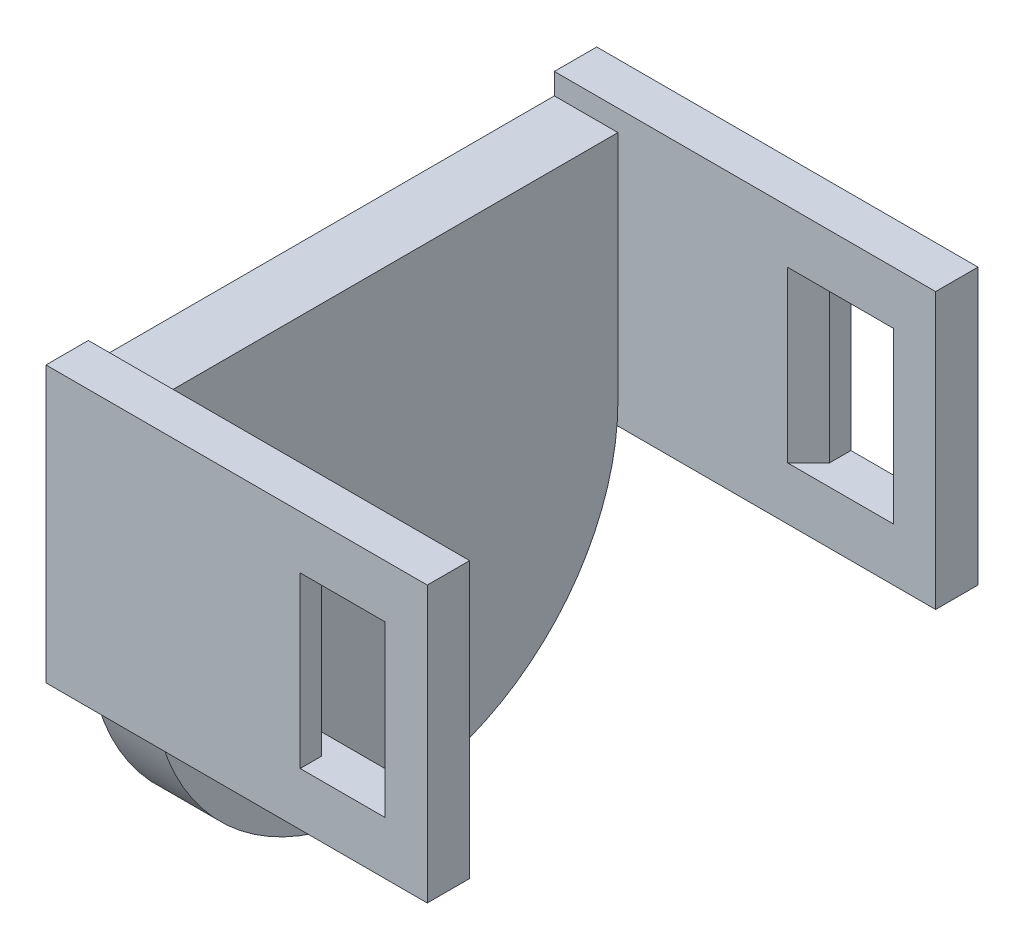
ISO-10303-21;
HEADER;
FILE_DESCRIPTION(('STEP AP214'),'2;1');
FILE_NAME('part.step','',(''),(''),'','','');
FILE_SCHEMA(('AUTOMOTIVE_DESIGN { 1 0 10303 214 1 1 1 1 }'));
ENDSEC;
DATA;
#1=APPLICATION_CONTEXT('core data for automotive mechanical design processes');
#2=APPLICATION_PROTOCOL_DEFINITION('international standard','automotive_design',2000,#1);
#3=PRODUCT_CONTEXT('',#1,'mechanical');
#4=PRODUCT('Part','Part','',(#3));
#5=PRODUCT_RELATED_PRODUCT_CATEGORY('part','',(#4));
#6=PRODUCT_DEFINITION_FORMATION('','',#4);
#7=PRODUCT_DEFINITION_CONTEXT('part definition',#1,'design');
#8=PRODUCT_DEFINITION('design','',#6,#7);
#9=PRODUCT_DEFINITION_SHAPE('','',#8);
#10=(LENGTH_UNIT() NAMED_UNIT(*) SI_UNIT(.MILLI.,.METRE.));
#11=(NAMED_UNIT(*) PLANE_ANGLE_UNIT() SI_UNIT($,.RADIAN.));
#12=(NAMED_UNIT(*) SI_UNIT($,.STERADIAN.) SOLID_ANGLE_UNIT());
#13=UNCERTAINTY_MEASURE_WITH_UNIT(LENGTH_MEASURE(1.E-05),#10,'distance_accuracy_value','');
#14=(GEOMETRIC_REPRESENTATION_CONTEXT(3) GLOBAL_UNCERTAINTY_ASSIGNED_CONTEXT((#13)) GLOBAL_UNIT_ASSIGNED_CONTEXT((#10,
#11,#12)) REPRESENTATION_CONTEXT('',''));
#15=CARTESIAN_POINT('',(0.,0.,0.));
#16=DIRECTION('',(0.,0.,1.));
#17=DIRECTION('',(1.,0.,0.));
#18=AXIS2_PLACEMENT_3D('',#15,#16,#17);
#19=CARTESIAN_POINT('',(3.,0.,0.));
#20=DIRECTION('',(1.,0.,0.));
#21=DIRECTION('',(0.,0.,-1.));
#22=AXIS2_PLACEMENT_3D('',#19,#20,#21);
#23=PLANE('',#22);
#24=CARTESIAN_POINT('',(3.,0.,0.));
#25=DIRECTION('',(1.,0.,0.));
#26=DIRECTION('',(0.,0.,-1.));
#27=AXIS2_PLACEMENT_3D('',#24,#25,#26);
#28=CIRCLE('',#27,11.);
#29=CARTESIAN_POINT('',(3.,0.,11.));
#30=VERTEX_POINT('',#29);
#31=CARTESIAN_POINT('',(3.,0.,-11.));
#32=VERTEX_POINT('',#31);
#33=EDGE_CURVE('E379',#30,#32,#28,.T.);
#34=ORIENTED_EDGE('',*,*,#33,.T.);
#35=DIRECTION('',(0.,-1.,0.));
#36=VECTOR('',#35,1.);
#37=CARTESIAN_POINT('',(3.,12.,-11.));
#38=LINE('',#37,#36);
#39=CARTESIAN_POINT('',(3.,11.,-11.));
#40=VERTEX_POINT('',#39);
#41=EDGE_CURVE('E269',#40,#32,#38,.T.);
#42=ORIENTED_EDGE('',*,*,#41,.F.);
#43=DIRECTION('',(0.,0.,1.));
#44=VECTOR('',#43,1.);
#45=CARTESIAN_POINT('',(3.,11.,11.));
#46=LINE('',#45,#44);
#47=CARTESIAN_POINT('',(3.,11.,11.));
#48=VERTEX_POINT('',#47);
#49=EDGE_CURVE('E382',#40,#48,#46,.T.);
#50=ORIENTED_EDGE('',*,*,#49,.T.);
#51=DIRECTION('',(0.,-1.,0.));
#52=VECTOR('',#51,1.);
#53=CARTESIAN_POINT('',(3.,12.,11.));
#54=LINE('',#53,#52);
#55=EDGE_CURVE('E306',#48,#30,#54,.T.);
#56=ORIENTED_EDGE('',*,*,#55,.T.);
#57=EDGE_LOOP('',(#34,#42,#50,#56));
#58=FACE_BOUND('',#57,.T.);
#59=ADVANCED_FACE('F45',(#58),#23,.T.);
#60=CARTESIAN_POINT('',(3.,11.,11.));
#61=DIRECTION('',(0.,-1.,0.));
#62=DIRECTION('',(0.,0.,-1.));
#63=AXIS2_PLACEMENT_3D('',#60,#61,#62);
#64=PLANE('',#63);
#65=DIRECTION('',(1.,0.,0.));
#66=VECTOR('',#65,1.);
#67=CARTESIAN_POINT('',(0.,11.,-11.));
#68=LINE('',#67,#66);
#69=CARTESIAN_POINT('',(0.,11.,-11.));
#70=VERTEX_POINT('',#69);
#71=EDGE_CURVE('E336',#70,#40,#68,.T.);
#72=ORIENTED_EDGE('',*,*,#71,.F.);
#73=DIRECTION('',(0.,0.,1.));
#74=VECTOR('',#73,1.);
#75=CARTESIAN_POINT('',(0.,11.,11.));
#76=LINE('',#75,#74);
#77=CARTESIAN_POINT('',(0.,11.,11.));
#78=VERTEX_POINT('',#77);
#79=EDGE_CURVE('E383',#70,#78,#76,.T.);
#80=ORIENTED_EDGE('',*,*,#79,.T.);
#81=DIRECTION('',(-1.,0.,0.));
#82=VECTOR('',#81,1.);
#83=CARTESIAN_POINT('',(3.,11.,11.));
#84=LINE('',#83,#82);
#85=EDGE_CURVE('E353',#48,#78,#84,.T.);
#86=ORIENTED_EDGE('',*,*,#85,.F.);
#87=ORIENTED_EDGE('',*,*,#49,.F.);
#88=EDGE_LOOP('',(#72,#80,#86,#87));
#89=FACE_BOUND('',#88,.T.);
#90=ADVANCED_FACE('F456',(#89),#64,.F.);
#91=CARTESIAN_POINT('',(3.,0.,0.));
#92=DIRECTION('',(-1.,0.,0.));
#93=DIRECTION('',(0.,0.,1.));
#94=AXIS2_PLACEMENT_3D('',#91,#92,#93);
#95=CYLINDRICAL_SURFACE('',#94,11.);
#96=CARTESIAN_POINT('',(0.,0.,0.));
#97=DIRECTION('',(1.,0.,0.));
#98=DIRECTION('',(0.,0.,-1.));
#99=AXIS2_PLACEMENT_3D('',#96,#97,#98);
#100=CIRCLE('',#99,11.);
#101=CARTESIAN_POINT('',(0.,0.,11.));
#102=VERTEX_POINT('',#101);
#103=CARTESIAN_POINT('',(0.,0.,-11.));
#104=VERTEX_POINT('',#103);
#105=EDGE_CURVE('E378',#102,#104,#100,.T.);
#106=ORIENTED_EDGE('',*,*,#105,.T.);
#107=DIRECTION('',(-1.,0.,0.));
#108=VECTOR('',#107,1.);
#109=CARTESIAN_POINT('',(3.,0.,-11.));
#110=LINE('',#109,#108);
#111=EDGE_CURVE('E311',#32,#104,#110,.T.);
#112=ORIENTED_EDGE('',*,*,#111,.F.);
#113=ORIENTED_EDGE('',*,*,#33,.F.);
#114=DIRECTION('',(-1.,0.,0.));
#115=VECTOR('',#114,1.);
#116=CARTESIAN_POINT('',(3.,0.,11.));
#117=LINE('',#116,#115);
#118=EDGE_CURVE('E386',#30,#102,#117,.T.);
#119=ORIENTED_EDGE('',*,*,#118,.T.);
#120=EDGE_LOOP('',(#106,#112,#113,#119));
#121=FACE_BOUND('',#120,.T.);
#122=ADVANCED_FACE('F462',(#121),#95,.T.);
#123=CARTESIAN_POINT('',(0.,0.,0.));
#124=DIRECTION('',(1.,0.,0.));
#125=DIRECTION('',(0.,0.,-1.));
#126=AXIS2_PLACEMENT_3D('',#123,#124,#125);
#127=PLANE('',#126);
#128=ORIENTED_EDGE('',*,*,#105,.F.);
#129=DIRECTION('',(0.,1.,0.));
#130=VECTOR('',#129,1.);
#131=CARTESIAN_POINT('',(0.,-1.,11.));
#132=LINE('',#131,#130);
#133=CARTESIAN_POINT('',(0.,-1.,11.));
#134=VERTEX_POINT('',#133);
#135=EDGE_CURVE('E320',#134,#102,#132,.T.);
#136=ORIENTED_EDGE('',*,*,#135,.F.);
#137=DIRECTION('',(0.,0.,-1.));
#138=VECTOR('',#137,1.);
#139=CARTESIAN_POINT('',(0.,-1.,13.));
#140=LINE('',#139,#138);
#141=CARTESIAN_POINT('',(0.,-1.,13.));
#142=VERTEX_POINT('',#141);
#143=EDGE_CURVE('E317',#142,#134,#140,.T.);
#144=ORIENTED_EDGE('',*,*,#143,.F.);
#145=DIRECTION('',(0.,-1.,0.));
#146=VECTOR('',#145,1.);
#147=CARTESIAN_POINT('',(0.,11.,13.));
#148=LINE('',#147,#146);
#149=CARTESIAN_POINT('',(0.,12.,13.));
#150=VERTEX_POINT('',#149);
#151=EDGE_CURVE('E375',#150,#142,#148,.T.);
#152=ORIENTED_EDGE('',*,*,#151,.F.);
#153=DIRECTION('',(0.,0.,-1.));
#154=VECTOR('',#153,1.);
#155=CARTESIAN_POINT('',(0.,12.,13.));
#156=LINE('',#155,#154);
#157=CARTESIAN_POINT('',(0.,12.,11.));
#158=VERTEX_POINT('',#157);
#159=EDGE_CURVE('E357',#150,#158,#156,.T.);
#160=ORIENTED_EDGE('',*,*,#159,.T.);
#161=DIRECTION('',(0.,-1.,0.));
#162=VECTOR('',#161,1.);
#163=CARTESIAN_POINT('',(0.,12.,11.));
#164=LINE('',#163,#162);
#165=EDGE_CURVE('E365',#158,#78,#164,.T.);
#166=ORIENTED_EDGE('',*,*,#165,.T.);
#167=ORIENTED_EDGE('',*,*,#79,.F.);
#168=DIRECTION('',(0.,-1.,0.));
#169=VECTOR('',#168,1.);
#170=CARTESIAN_POINT('',(0.,12.,-11.));
#171=LINE('',#170,#169);
#172=CARTESIAN_POINT('',(0.,12.,-11.));
#173=VERTEX_POINT('',#172);
#174=EDGE_CURVE('E346',#173,#70,#171,.T.);
#175=ORIENTED_EDGE('',*,*,#174,.F.);
#176=DIRECTION('',(0.,0.,1.));
#177=VECTOR('',#176,1.);
#178=CARTESIAN_POINT('',(0.,12.,-13.));
#179=LINE('',#178,#177);
#180=CARTESIAN_POINT('',(0.,12.,-13.));
#181=VERTEX_POINT('',#180);
#182=EDGE_CURVE('E343',#181,#173,#179,.T.);
#183=ORIENTED_EDGE('',*,*,#182,.F.);
#184=DIRECTION('',(0.,-1.,0.));
#185=VECTOR('',#184,1.);
#186=CARTESIAN_POINT('',(0.,11.,-13.));
#187=LINE('',#186,#185);
#188=CARTESIAN_POINT('',(0.,-1.,-13.));
#189=VERTEX_POINT('',#188);
#190=EDGE_CURVE('E372',#181,#189,#187,.T.);
#191=ORIENTED_EDGE('',*,*,#190,.T.);
#192=DIRECTION('',(0.,0.,-1.));
#193=VECTOR('',#192,1.);
#194=CARTESIAN_POINT('',(0.,-1.,-11.));
#195=LINE('',#194,#193);
#196=CARTESIAN_POINT('',(0.,-1.,-11.));
#197=VERTEX_POINT('',#196);
#198=EDGE_CURVE('E329',#197,#189,#195,.T.);
#199=ORIENTED_EDGE('',*,*,#198,.F.);
#200=DIRECTION('',(0.,1.,0.));
#201=VECTOR('',#200,1.);
#202=CARTESIAN_POINT('',(0.,-1.,-11.));
#203=LINE('',#202,#201);
#204=EDGE_CURVE('E333',#197,#104,#203,.T.);
#205=ORIENTED_EDGE('',*,*,#204,.T.);
#206=EDGE_LOOP('',(#128,#136,#144,#152,#160,#166,#167,#175,#183,#191,#199,#205));
#207=FACE_BOUND('',#206,.T.);
#208=ADVANCED_FACE('F468',(#207),#127,.F.);
#209=CARTESIAN_POINT('',(0.,0.,13.));
#210=DIRECTION('',(0.,0.,-1.));
#211=DIRECTION('',(-1.,0.,0.));
#212=AXIS2_PLACEMENT_3D('',#209,#210,#211);
#213=PLANE('',#212);
#214=DIRECTION('',(0.,-1.,0.));
#215=VECTOR('',#214,1.);
#216=CARTESIAN_POINT('',(16.,9.5,13.));
#217=LINE('',#216,#215);
#218=CARTESIAN_POINT('',(16.,9.5,13.));
#219=VERTEX_POINT('',#218);
#220=CARTESIAN_POINT('',(16.,1.5,13.));
#221=VERTEX_POINT('',#220);
#222=EDGE_CURVE('E240',#219,#221,#217,.T.);
#223=ORIENTED_EDGE('',*,*,#222,.T.);
#224=DIRECTION('',(1.,0.,0.));
#225=VECTOR('',#224,1.);
#226=CARTESIAN_POINT('',(12.,1.5,13.));
#227=LINE('',#226,#225);
#228=CARTESIAN_POINT('',(12.,1.5,13.));
#229=VERTEX_POINT('',#228);
#230=EDGE_CURVE('E237',#229,#221,#227,.T.);
#231=ORIENTED_EDGE('',*,*,#230,.F.);
#232=DIRECTION('',(0.,-1.,0.));
#233=VECTOR('',#232,1.);
#234=CARTESIAN_POINT('',(12.,9.5,13.));
#235=LINE('',#234,#233);
#236=CARTESIAN_POINT('',(12.,9.5,13.));
#237=VERTEX_POINT('',#236);
#238=EDGE_CURVE('E226',#237,#229,#235,.T.);
#239=ORIENTED_EDGE('',*,*,#238,.F.);
#240=DIRECTION('',(1.,0.,0.));
#241=VECTOR('',#240,1.);
#242=CARTESIAN_POINT('',(12.,9.5,13.));
#243=LINE('',#242,#241);
#244=EDGE_CURVE('E230',#237,#219,#243,.T.);
#245=ORIENTED_EDGE('',*,*,#244,.T.);
#246=EDGE_LOOP('',(#223,#231,#239,#245));
#247=FACE_BOUND('',#246,.T.);
#248=ORIENTED_EDGE('',*,*,#151,.T.);
#249=DIRECTION('',(1.,0.,0.));
#250=VECTOR('',#249,1.);
#251=CARTESIAN_POINT('',(0.,-1.,13.));
#252=LINE('',#251,#250);
#253=CARTESIAN_POINT('',(18.,-1.,13.));
#254=VERTEX_POINT('',#253);
#255=EDGE_CURVE('E314',#142,#254,#252,.T.);
#256=ORIENTED_EDGE('',*,*,#255,.T.);
#257=DIRECTION('',(0.,-1.,0.));
#258=VECTOR('',#257,1.);
#259=CARTESIAN_POINT('',(18.,12.,13.));
#260=LINE('',#259,#258);
#261=CARTESIAN_POINT('',(18.,12.,13.));
#262=VERTEX_POINT('',#261);
#263=EDGE_CURVE('E301',#262,#254,#260,.T.);
#264=ORIENTED_EDGE('',*,*,#263,.F.);
#265=DIRECTION('',(-1.,0.,0.));
#266=VECTOR('',#265,1.);
#267=CARTESIAN_POINT('',(3.,12.,13.));
#268=LINE('',#267,#266);
#269=EDGE_CURVE('E361',#262,#150,#268,.T.);
#270=ORIENTED_EDGE('',*,*,#269,.T.);
#271=EDGE_LOOP('',(#248,#256,#264,#270));
#272=FACE_BOUND('',#271,.T.);
#273=ADVANCED_FACE('F436',(#247,#272),#213,.F.);
#274=CARTESIAN_POINT('',(0.,0.,-13.));
#275=DIRECTION('',(0.,0.,1.));
#276=DIRECTION('',(1.,0.,0.));
#277=AXIS2_PLACEMENT_3D('',#274,#275,#276);
#278=PLANE('',#277);
#279=DIRECTION('',(0.,-1.,0.));
#280=VECTOR('',#279,1.);
#281=CARTESIAN_POINT('',(12.,9.5,-13.));
#282=LINE('',#281,#280);
#283=CARTESIAN_POINT('',(12.,9.5,-13.));
#284=VERTEX_POINT('',#283);
#285=CARTESIAN_POINT('',(12.,1.5,-13.));
#286=VERTEX_POINT('',#285);
#287=EDGE_CURVE('E224',#284,#286,#282,.T.);
#288=ORIENTED_EDGE('',*,*,#287,.T.);
#289=DIRECTION('',(1.,0.,0.));
#290=VECTOR('',#289,1.);
#291=CARTESIAN_POINT('',(12.,1.5,-13.));
#292=LINE('',#291,#290);
#293=CARTESIAN_POINT('',(16.,1.5,-13.));
#294=VERTEX_POINT('',#293);
#295=EDGE_CURVE('E207',#286,#294,#292,.T.);
#296=ORIENTED_EDGE('',*,*,#295,.T.);
#297=DIRECTION('',(0.,-1.,0.));
#298=VECTOR('',#297,1.);
#299=CARTESIAN_POINT('',(16.,9.5,-13.));
#300=LINE('',#299,#298);
#301=CARTESIAN_POINT('',(16.,9.5,-13.));
#302=VERTEX_POINT('',#301);
#303=EDGE_CURVE('E194',#302,#294,#300,.T.);
#304=ORIENTED_EDGE('',*,*,#303,.F.);
#305=DIRECTION('',(1.,0.,0.));
#306=VECTOR('',#305,1.);
#307=CARTESIAN_POINT('',(12.,9.5,-13.));
#308=LINE('',#307,#306);
#309=EDGE_CURVE('E206',#284,#302,#308,.T.);
#310=ORIENTED_EDGE('',*,*,#309,.F.);
#311=EDGE_LOOP('',(#288,#296,#304,#310));
#312=FACE_BOUND('',#311,.T.);
#313=DIRECTION('',(1.,0.,0.));
#314=VECTOR('',#313,1.);
#315=CARTESIAN_POINT('',(0.,12.,-13.));
#316=LINE('',#315,#314);
#317=CARTESIAN_POINT('',(18.,12.,-13.));
#318=VERTEX_POINT('',#317);
#319=EDGE_CURVE('E340',#181,#318,#316,.T.);
#320=ORIENTED_EDGE('',*,*,#319,.T.);
#321=DIRECTION('',(0.,-1.,0.));
#322=VECTOR('',#321,1.);
#323=CARTESIAN_POINT('',(18.,12.,-13.));
#324=LINE('',#323,#322);
#325=CARTESIAN_POINT('',(18.,-1.,-13.));
#326=VERTEX_POINT('',#325);
#327=EDGE_CURVE('E274',#318,#326,#324,.T.);
#328=ORIENTED_EDGE('',*,*,#327,.T.);
#329=DIRECTION('',(1.,0.,0.));
#330=VECTOR('',#329,1.);
#331=CARTESIAN_POINT('',(0.,-1.,-13.));
#332=LINE('',#331,#330);
#333=EDGE_CURVE('E323',#189,#326,#332,.T.);
#334=ORIENTED_EDGE('',*,*,#333,.F.);
#335=ORIENTED_EDGE('',*,*,#190,.F.);
#336=EDGE_LOOP('',(#320,#328,#334,#335));
#337=FACE_BOUND('',#336,.T.);
#338=ADVANCED_FACE('F221',(#312,#337),#278,.F.);
#339=CARTESIAN_POINT('',(3.,12.,11.));
#340=DIRECTION('',(0.,0.,1.));
#341=DIRECTION('',(1.,0.,0.));
#342=AXIS2_PLACEMENT_3D('',#339,#340,#341);
#343=PLANE('',#342);
#344=DIRECTION('',(0.,-1.,0.));
#345=VECTOR('',#344,1.);
#346=CARTESIAN_POINT('',(11.,12.,11.));
#347=LINE('',#346,#345);
#348=CARTESIAN_POINT('',(11.,9.5,11.));
#349=VERTEX_POINT('',#348);
#350=CARTESIAN_POINT('',(11.,1.5,11.));
#351=VERTEX_POINT('',#350);
#352=EDGE_CURVE('E418',#349,#351,#347,.T.);
#353=ORIENTED_EDGE('',*,*,#352,.T.);
#354=DIRECTION('',(1.,0.,0.));
#355=VECTOR('',#354,1.);
#356=CARTESIAN_POINT('',(3.,1.5,11.));
#357=LINE('',#356,#355);
#358=CARTESIAN_POINT('',(16.,1.5,11.));
#359=VERTEX_POINT('',#358);
#360=EDGE_CURVE('E265',#351,#359,#357,.T.);
#361=ORIENTED_EDGE('',*,*,#360,.T.);
#362=DIRECTION('',(0.,-1.,0.));
#363=VECTOR('',#362,1.);
#364=CARTESIAN_POINT('',(16.,12.,11.));
#365=LINE('',#364,#363);
#366=CARTESIAN_POINT('',(16.,9.5,11.));
#367=VERTEX_POINT('',#366);
#368=EDGE_CURVE('E250',#367,#359,#365,.T.);
#369=ORIENTED_EDGE('',*,*,#368,.F.);
#370=DIRECTION('',(1.,0.,0.));
#371=VECTOR('',#370,1.);
#372=CARTESIAN_POINT('',(3.,9.5,11.));
#373=LINE('',#372,#371);
#374=EDGE_CURVE('E261',#349,#367,#373,.T.);
#375=ORIENTED_EDGE('',*,*,#374,.F.);
#376=EDGE_LOOP('',(#353,#361,#369,#375));
#377=FACE_BOUND('',#376,.T.);
#378=ORIENTED_EDGE('',*,*,#85,.T.);
#379=ORIENTED_EDGE('',*,*,#165,.F.);
#380=DIRECTION('',(-1.,0.,0.));
#381=VECTOR('',#380,1.);
#382=CARTESIAN_POINT('',(3.,12.,11.));
#383=LINE('',#382,#381);
#384=CARTESIAN_POINT('',(18.,12.,11.));
#385=VERTEX_POINT('',#384);
#386=EDGE_CURVE('E354',#385,#158,#383,.T.);
#387=ORIENTED_EDGE('',*,*,#386,.F.);
#388=DIRECTION('',(0.,-1.,0.));
#389=VECTOR('',#388,1.);
#390=CARTESIAN_POINT('',(18.,12.,11.));
#391=LINE('',#390,#389);
#392=CARTESIAN_POINT('',(18.,-1.,11.));
#393=VERTEX_POINT('',#392);
#394=EDGE_CURVE('E293',#385,#393,#391,.T.);
#395=ORIENTED_EDGE('',*,*,#394,.T.);
#396=DIRECTION('',(1.,0.,0.));
#397=VECTOR('',#396,1.);
#398=CARTESIAN_POINT('',(0.,-1.,11.));
#399=LINE('',#398,#397);
#400=EDGE_CURVE('E305',#134,#393,#399,.T.);
#401=ORIENTED_EDGE('',*,*,#400,.F.);
#402=ORIENTED_EDGE('',*,*,#135,.T.);
#403=ORIENTED_EDGE('',*,*,#118,.F.);
#404=ORIENTED_EDGE('',*,*,#55,.F.);
#405=EDGE_LOOP('',(#378,#379,#387,#395,#401,#402,#403,#404));
#406=FACE_BOUND('',#405,.T.);
#407=ADVANCED_FACE('F445',(#377,#406),#343,.F.);
#408=CARTESIAN_POINT('',(0.,12.,0.));
#409=DIRECTION('',(0.,-1.,0.));
#410=DIRECTION('',(0.,0.,-1.));
#411=AXIS2_PLACEMENT_3D('',#408,#409,#410);
#412=PLANE('',#411);
#413=ORIENTED_EDGE('',*,*,#386,.T.);
#414=ORIENTED_EDGE('',*,*,#159,.F.);
#415=ORIENTED_EDGE('',*,*,#269,.F.);
#416=DIRECTION('',(0.,0.,-1.));
#417=VECTOR('',#416,1.);
#418=CARTESIAN_POINT('',(18.,12.,13.));
#419=LINE('',#418,#417);
#420=EDGE_CURVE('E297',#262,#385,#419,.T.);
#421=ORIENTED_EDGE('',*,*,#420,.T.);
#422=EDGE_LOOP('',(#413,#414,#415,#421));
#423=FACE_BOUND('',#422,.T.);
#424=ADVANCED_FACE('F507',(#423),#412,.F.);
#425=CARTESIAN_POINT('',(0.,12.,-11.));
#426=DIRECTION('',(0.,0.,-1.));
#427=DIRECTION('',(-1.,0.,0.));
#428=AXIS2_PLACEMENT_3D('',#425,#426,#427);
#429=PLANE('',#428);
#430=DIRECTION('',(0.,1.,0.));
#431=VECTOR('',#430,1.);
#432=CARTESIAN_POINT('',(11.,12.,-11.));
#433=LINE('',#432,#431);
#434=CARTESIAN_POINT('',(11.,1.5,-11.));
#435=VERTEX_POINT('',#434);
#436=CARTESIAN_POINT('',(11.,9.5,-11.));
#437=VERTEX_POINT('',#436);
#438=EDGE_CURVE('E405',#435,#437,#433,.T.);
#439=ORIENTED_EDGE('',*,*,#438,.T.);
#440=DIRECTION('',(-1.,0.,0.));
#441=VECTOR('',#440,1.);
#442=CARTESIAN_POINT('',(0.,9.5,-11.));
#443=LINE('',#442,#441);
#444=CARTESIAN_POINT('',(16.,9.5,-11.));
#445=VERTEX_POINT('',#444);
#446=EDGE_CURVE('E400',#445,#437,#443,.T.);
#447=ORIENTED_EDGE('',*,*,#446,.F.);
#448=DIRECTION('',(0.,1.,0.));
#449=VECTOR('',#448,1.);
#450=CARTESIAN_POINT('',(16.,12.,-11.));
#451=LINE('',#450,#449);
#452=CARTESIAN_POINT('',(16.,1.5,-11.));
#453=VERTEX_POINT('',#452);
#454=EDGE_CURVE('E310',#453,#445,#451,.T.);
#455=ORIENTED_EDGE('',*,*,#454,.F.);
#456=DIRECTION('',(-1.,0.,0.));
#457=VECTOR('',#456,1.);
#458=CARTESIAN_POINT('',(0.,1.5,-11.));
#459=LINE('',#458,#457);
#460=EDGE_CURVE('E215',#453,#435,#459,.T.);
#461=ORIENTED_EDGE('',*,*,#460,.T.);
#462=EDGE_LOOP('',(#439,#447,#455,#461));
#463=FACE_BOUND('',#462,.T.);
#464=ORIENTED_EDGE('',*,*,#71,.T.);
#465=ORIENTED_EDGE('',*,*,#41,.T.);
#466=ORIENTED_EDGE('',*,*,#111,.T.);
#467=ORIENTED_EDGE('',*,*,#204,.F.);
#468=DIRECTION('',(1.,0.,0.));
#469=VECTOR('',#468,1.);
#470=CARTESIAN_POINT('',(0.,-1.,-11.));
#471=LINE('',#470,#469);
#472=CARTESIAN_POINT('',(18.,-1.,-11.));
#473=VERTEX_POINT('',#472);
#474=EDGE_CURVE('E326',#197,#473,#471,.T.);
#475=ORIENTED_EDGE('',*,*,#474,.T.);
#476=DIRECTION('',(0.,-1.,0.));
#477=VECTOR('',#476,1.);
#478=CARTESIAN_POINT('',(18.,12.,-11.));
#479=LINE('',#478,#477);
#480=CARTESIAN_POINT('',(18.,12.,-11.));
#481=VERTEX_POINT('',#480);
#482=EDGE_CURVE('E282',#481,#473,#479,.T.);
#483=ORIENTED_EDGE('',*,*,#482,.F.);
#484=DIRECTION('',(1.,0.,0.));
#485=VECTOR('',#484,1.);
#486=CARTESIAN_POINT('',(0.,12.,-11.));
#487=LINE('',#486,#485);
#488=EDGE_CURVE('E337',#173,#481,#487,.T.);
#489=ORIENTED_EDGE('',*,*,#488,.F.);
#490=ORIENTED_EDGE('',*,*,#174,.T.);
#491=EDGE_LOOP('',(#464,#465,#466,#467,#475,#483,#489,#490));
#492=FACE_BOUND('',#491,.T.);
#493=ADVANCED_FACE('F490',(#463,#492),#429,.F.);
#494=CARTESIAN_POINT('',(0.,12.,0.));
#495=DIRECTION('',(0.,-1.,0.));
#496=DIRECTION('',(0.,0.,-1.));
#497=AXIS2_PLACEMENT_3D('',#494,#495,#496);
#498=PLANE('',#497);
#499=ORIENTED_EDGE('',*,*,#488,.T.);
#500=DIRECTION('',(0.,0.,-1.));
#501=VECTOR('',#500,1.);
#502=CARTESIAN_POINT('',(18.,12.,-11.));
#503=LINE('',#502,#501);
#504=EDGE_CURVE('E278',#481,#318,#503,.T.);
#505=ORIENTED_EDGE('',*,*,#504,.T.);
#506=ORIENTED_EDGE('',*,*,#319,.F.);
#507=ORIENTED_EDGE('',*,*,#182,.T.);
#508=EDGE_LOOP('',(#499,#505,#506,#507));
#509=FACE_BOUND('',#508,.T.);
#510=ADVANCED_FACE('F514',(#509),#498,.F.);
#511=CARTESIAN_POINT('',(0.,-1.,0.));
#512=DIRECTION('',(0.,1.,0.));
#513=DIRECTION('',(0.,0.,1.));
#514=AXIS2_PLACEMENT_3D('',#511,#512,#513);
#515=PLANE('',#514);
#516=ORIENTED_EDGE('',*,*,#333,.T.);
#517=DIRECTION('',(0.,0.,-1.));
#518=VECTOR('',#517,1.);
#519=CARTESIAN_POINT('',(18.,-1.,-11.));
#520=LINE('',#519,#518);
#521=EDGE_CURVE('E270',#473,#326,#520,.T.);
#522=ORIENTED_EDGE('',*,*,#521,.F.);
#523=ORIENTED_EDGE('',*,*,#474,.F.);
#524=ORIENTED_EDGE('',*,*,#198,.T.);
#525=EDGE_LOOP('',(#516,#522,#523,#524));
#526=FACE_BOUND('',#525,.T.);
#527=ADVANCED_FACE('F518',(#526),#515,.F.);
#528=CARTESIAN_POINT('',(0.,-1.,0.));
#529=DIRECTION('',(0.,1.,0.));
#530=DIRECTION('',(0.,0.,1.));
#531=AXIS2_PLACEMENT_3D('',#528,#529,#530);
#532=PLANE('',#531);
#533=ORIENTED_EDGE('',*,*,#400,.T.);
#534=DIRECTION('',(0.,0.,-1.));
#535=VECTOR('',#534,1.);
#536=CARTESIAN_POINT('',(18.,-1.,13.));
#537=LINE('',#536,#535);
#538=EDGE_CURVE('E286',#254,#393,#537,.T.);
#539=ORIENTED_EDGE('',*,*,#538,.F.);
#540=ORIENTED_EDGE('',*,*,#255,.F.);
#541=ORIENTED_EDGE('',*,*,#143,.T.);
#542=EDGE_LOOP('',(#533,#539,#540,#541));
#543=FACE_BOUND('',#542,.T.);
#544=ADVANCED_FACE('F499',(#543),#532,.F.);
#545=CARTESIAN_POINT('',(18.,0.,0.));
#546=DIRECTION('',(-1.,0.,0.));
#547=DIRECTION('',(0.,0.,1.));
#548=AXIS2_PLACEMENT_3D('',#545,#546,#547);
#549=PLANE('',#548);
#550=ORIENTED_EDGE('',*,*,#538,.T.);
#551=ORIENTED_EDGE('',*,*,#394,.F.);
#552=ORIENTED_EDGE('',*,*,#420,.F.);
#553=ORIENTED_EDGE('',*,*,#263,.T.);
#554=EDGE_LOOP('',(#550,#551,#552,#553));
#555=FACE_BOUND('',#554,.T.);
#556=ADVANCED_FACE('F502',(#555),#549,.F.);
#557=CARTESIAN_POINT('',(18.,0.,0.));
#558=DIRECTION('',(-1.,0.,0.));
#559=DIRECTION('',(0.,0.,1.));
#560=AXIS2_PLACEMENT_3D('',#557,#558,#559);
#561=PLANE('',#560);
#562=ORIENTED_EDGE('',*,*,#521,.T.);
#563=ORIENTED_EDGE('',*,*,#327,.F.);
#564=ORIENTED_EDGE('',*,*,#504,.F.);
#565=ORIENTED_EDGE('',*,*,#482,.T.);
#566=EDGE_LOOP('',(#562,#563,#564,#565));
#567=FACE_BOUND('',#566,.T.);
#568=ADVANCED_FACE('F522',(#567),#561,.F.);
#569=CARTESIAN_POINT('',(16.,9.5,-13.));
#570=DIRECTION('',(-1.,0.,0.));
#571=DIRECTION('',(0.,0.,1.));
#572=AXIS2_PLACEMENT_3D('',#569,#570,#571);
#573=PLANE('',#572);
#574=ORIENTED_EDGE('',*,*,#454,.T.);
#575=DIRECTION('',(0.,0.,1.));
#576=VECTOR('',#575,1.);
#577=CARTESIAN_POINT('',(16.,9.5,-13.));
#578=LINE('',#577,#576);
#579=EDGE_CURVE('E200',#302,#445,#578,.T.);
#580=ORIENTED_EDGE('',*,*,#579,.F.);
#581=ORIENTED_EDGE('',*,*,#303,.T.);
#582=DIRECTION('',(0.,0.,1.));
#583=VECTOR('',#582,1.);
#584=CARTESIAN_POINT('',(16.,1.5,-13.));
#585=LINE('',#584,#583);
#586=EDGE_CURVE('E197',#294,#453,#585,.T.);
#587=ORIENTED_EDGE('',*,*,#586,.T.);
#588=EDGE_LOOP('',(#574,#580,#581,#587));
#589=FACE_BOUND('',#588,.T.);
#590=ADVANCED_FACE('F196',(#589),#573,.T.);
#591=CARTESIAN_POINT('',(12.,9.5,-13.));
#592=DIRECTION('',(0.,-1.,0.));
#593=DIRECTION('',(0.,0.,-1.));
#594=AXIS2_PLACEMENT_3D('',#591,#592,#593);
#595=PLANE('',#594);
#596=ORIENTED_EDGE('',*,*,#446,.T.);
#597=DIRECTION('',(-0.707106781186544,0.,0.707106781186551));
#598=VECTOR('',#597,1.);
#599=CARTESIAN_POINT('',(11.,9.5,-11.));
#600=LINE('',#599,#598);
#601=CARTESIAN_POINT('',(12.,9.5,-12.));
#602=VERTEX_POINT('',#601);
#603=EDGE_CURVE('E412',#437,#602,#600,.F.);
#604=ORIENTED_EDGE('',*,*,#603,.T.);
#605=DIRECTION('',(0.,0.,1.));
#606=VECTOR('',#605,1.);
#607=CARTESIAN_POINT('',(12.,9.5,-13.));
#608=LINE('',#607,#606);
#609=EDGE_CURVE('E252',#284,#602,#608,.T.);
#610=ORIENTED_EDGE('',*,*,#609,.F.);
#611=ORIENTED_EDGE('',*,*,#309,.T.);
#612=ORIENTED_EDGE('',*,*,#579,.T.);
#613=EDGE_LOOP('',(#596,#604,#610,#611,#612));
#614=FACE_BOUND('',#613,.T.);
#615=ADVANCED_FACE('F529',(#614),#595,.T.);
#616=CARTESIAN_POINT('',(12.,9.5,-13.));
#617=DIRECTION('',(-1.,0.,0.));
#618=DIRECTION('',(0.,-1.,0.));
#619=AXIS2_PLACEMENT_3D('',#616,#617,#618);
#620=PLANE('',#619);
#621=ORIENTED_EDGE('',*,*,#609,.T.);
#622=DIRECTION('',(0.,-1.,0.));
#623=VECTOR('',#622,1.);
#624=CARTESIAN_POINT('',(12.,9.5,-12.));
#625=LINE('',#624,#623);
#626=CARTESIAN_POINT('',(12.,1.5,-12.));
#627=VERTEX_POINT('',#626);
#628=EDGE_CURVE('E409',#602,#627,#625,.T.);
#629=ORIENTED_EDGE('',*,*,#628,.T.);
#630=DIRECTION('',(0.,0.,1.));
#631=VECTOR('',#630,1.);
#632=CARTESIAN_POINT('',(12.,1.5,-13.));
#633=LINE('',#632,#631);
#634=EDGE_CURVE('E247',#286,#627,#633,.T.);
#635=ORIENTED_EDGE('',*,*,#634,.F.);
#636=ORIENTED_EDGE('',*,*,#287,.F.);
#637=EDGE_LOOP('',(#621,#629,#635,#636));
#638=FACE_BOUND('',#637,.T.);
#639=ADVANCED_FACE('F642',(#638),#620,.F.);
#640=CARTESIAN_POINT('',(12.,1.5,-13.));
#641=DIRECTION('',(0.,-1.,0.));
#642=DIRECTION('',(0.,0.,-1.));
#643=AXIS2_PLACEMENT_3D('',#640,#641,#642);
#644=PLANE('',#643);
#645=ORIENTED_EDGE('',*,*,#586,.F.);
#646=ORIENTED_EDGE('',*,*,#295,.F.);
#647=ORIENTED_EDGE('',*,*,#634,.T.);
#648=DIRECTION('',(0.707106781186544,0.,-0.707106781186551));
#649=VECTOR('',#648,1.);
#650=CARTESIAN_POINT('',(12.5,1.5,-12.5));
#651=LINE('',#650,#649);
#652=EDGE_CURVE('E415',#627,#435,#651,.F.);
#653=ORIENTED_EDGE('',*,*,#652,.T.);
#654=ORIENTED_EDGE('',*,*,#460,.F.);
#655=EDGE_LOOP('',(#645,#646,#647,#653,#654));
#656=FACE_BOUND('',#655,.T.);
#657=ADVANCED_FACE('F211',(#656),#644,.F.);
#658=ORIENTED_EDGE('',*,*,#360,.F.);
#659=DIRECTION('',(-0.707106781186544,0.,-0.707106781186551));
#660=VECTOR('',#659,1.);
#661=CARTESIAN_POINT('',(-0.500000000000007,1.5,-0.500000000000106));
#662=LINE('',#661,#660);
#663=CARTESIAN_POINT('',(12.,1.5,12.));
#664=VERTEX_POINT('',#663);
#665=EDGE_CURVE('E55',#351,#664,#662,.F.);
#666=ORIENTED_EDGE('',*,*,#665,.T.);
#667=EDGE_CURVE('E251',#664,#229,#633,.T.);
#668=ORIENTED_EDGE('',*,*,#667,.T.);
#669=ORIENTED_EDGE('',*,*,#230,.T.);
#670=EDGE_CURVE('E219',#359,#221,#585,.T.);
#671=ORIENTED_EDGE('',*,*,#670,.F.);
#672=EDGE_LOOP('',(#658,#666,#668,#669,#671));
#673=FACE_BOUND('',#672,.T.);
#674=ADVANCED_FACE('F447',(#673),#644,.F.);
#675=ORIENTED_EDGE('',*,*,#667,.F.);
#676=DIRECTION('',(0.,1.,0.));
#677=VECTOR('',#676,1.);
#678=CARTESIAN_POINT('',(12.,9.5,12.));
#679=LINE('',#678,#677);
#680=CARTESIAN_POINT('',(12.,9.5,12.));
#681=VERTEX_POINT('',#680);
#682=EDGE_CURVE('E68',#664,#681,#679,.T.);
#683=ORIENTED_EDGE('',*,*,#682,.T.);
#684=EDGE_CURVE('E256',#681,#237,#608,.T.);
#685=ORIENTED_EDGE('',*,*,#684,.T.);
#686=ORIENTED_EDGE('',*,*,#238,.T.);
#687=EDGE_LOOP('',(#675,#683,#685,#686));
#688=FACE_BOUND('',#687,.T.);
#689=ADVANCED_FACE('F656',(#688),#620,.F.);
#690=ORIENTED_EDGE('',*,*,#374,.T.);
#691=EDGE_CURVE('E218',#367,#219,#578,.T.);
#692=ORIENTED_EDGE('',*,*,#691,.T.);
#693=ORIENTED_EDGE('',*,*,#244,.F.);
#694=ORIENTED_EDGE('',*,*,#684,.F.);
#695=DIRECTION('',(0.707106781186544,0.,0.707106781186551));
#696=VECTOR('',#695,1.);
#697=CARTESIAN_POINT('',(11.,9.5,11.));
#698=LINE('',#697,#696);
#699=EDGE_CURVE('E11',#681,#349,#698,.F.);
#700=ORIENTED_EDGE('',*,*,#699,.T.);
#701=EDGE_LOOP('',(#690,#692,#693,#694,#700));
#702=FACE_BOUND('',#701,.T.);
#703=ADVANCED_FACE('F441',(#702),#595,.T.);
#704=ORIENTED_EDGE('',*,*,#368,.T.);
#705=ORIENTED_EDGE('',*,*,#670,.T.);
#706=ORIENTED_EDGE('',*,*,#222,.F.);
#707=ORIENTED_EDGE('',*,*,#691,.F.);
#708=EDGE_LOOP('',(#704,#705,#706,#707));
#709=FACE_BOUND('',#708,.T.);
#710=ADVANCED_FACE('F432',(#709),#573,.T.);
#711=CARTESIAN_POINT('',(11.,12.,-11.));
#712=DIRECTION('',(-0.707106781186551,0.,-0.707106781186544));
#713=DIRECTION('',(0.,1.,0.));
#714=AXIS2_PLACEMENT_3D('',#711,#712,#713);
#715=PLANE('',#714);
#716=ORIENTED_EDGE('',*,*,#652,.F.);
#717=ORIENTED_EDGE('',*,*,#628,.F.);
#718=ORIENTED_EDGE('',*,*,#603,.F.);
#719=ORIENTED_EDGE('',*,*,#438,.F.);
#720=EDGE_LOOP('',(#716,#717,#718,#719));
#721=FACE_BOUND('',#720,.T.);
#722=ADVANCED_FACE('F450',(#721),#715,.F.);
#723=CARTESIAN_POINT('',(11.,12.,11.));
#724=DIRECTION('',(-0.707106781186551,0.,0.707106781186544));
#725=DIRECTION('',(0.,-1.,0.));
#726=AXIS2_PLACEMENT_3D('',#723,#724,#725);
#727=PLANE('',#726);
#728=ORIENTED_EDGE('',*,*,#699,.F.);
#729=ORIENTED_EDGE('',*,*,#682,.F.);
#730=ORIENTED_EDGE('',*,*,#665,.F.);
#731=ORIENTED_EDGE('',*,*,#352,.F.);
#732=EDGE_LOOP('',(#728,#729,#730,#731));
#733=FACE_BOUND('',#732,.T.);
#734=ADVANCED_FACE('F48',(#733),#727,.F.);
#735=CLOSED_SHELL('',(#59,#90,#122,#208,#273,#338,#407,#424,#493,#510,#527,#544,#556,#568,#590,
#615,#639,#657,#674,#689,#703,#710,#722,#734));
#736=MANIFOLD_SOLID_BREP('B2',#735);
#737=ADVANCED_BREP_SHAPE_REPRESENTATION('',(#18,#736),#14);
#738=SHAPE_DEFINITION_REPRESENTATION(#9,#737);
ENDSEC;
END-ISO-10303-21;
